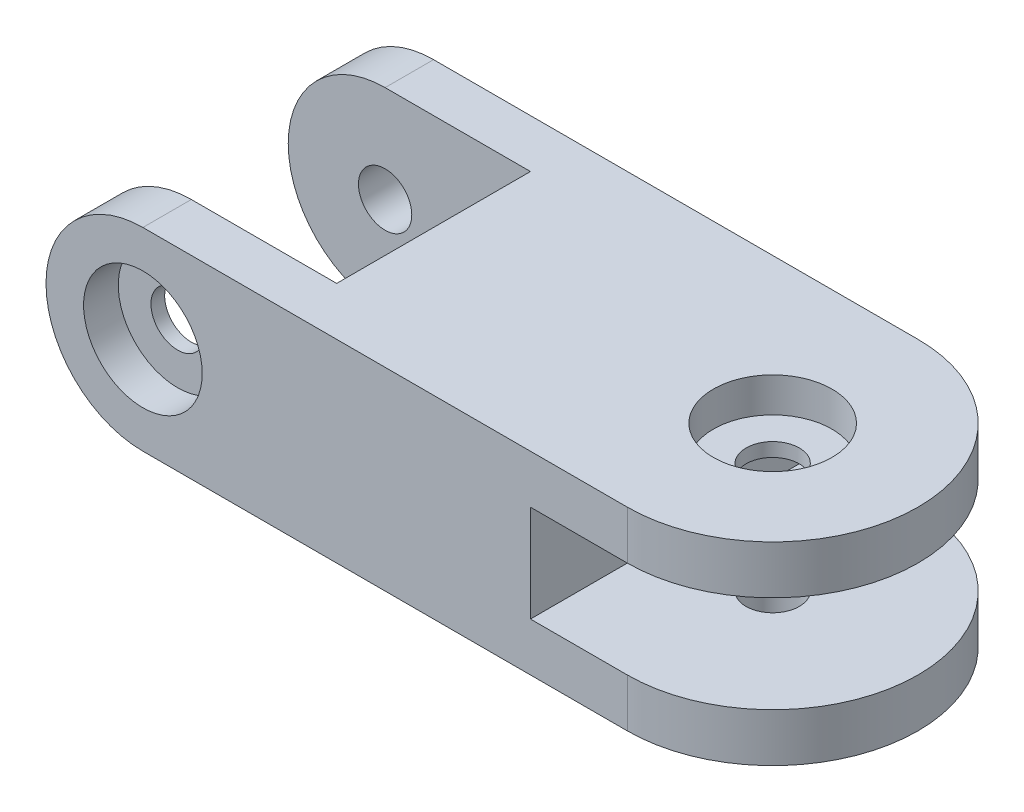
from build123d import *

# Parameters (mm, degrees)
SKETCH1_W                                         = 75
SKETCH1_H                                         = 20
EXTRUDE1_DEPTH                                    = 15
FILLET1_RADIUS                                    = 15
FILLET1_LENGTH                                    = 20
SKETCH3_W                                         = 25
SKETCH3_H                                         = 10
CUT_EXTRUDE1_DEPTH                                = 84.216584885
FILLET2_RADIUS                                    = 10
FILLET2_LENGTH                                    = 30
SKETCH4_W                                         = 25
SKETCH4_H                                         = 20
CUT_EXTRUDE2_DEPTH                                = 30
CBORE_FOR_M5_HEX_HEAD_BOLT1_D                     = 5.5
CBORE_FOR_M5_HEX_HEAD_BOLT1_CBORE_D               = 12.24
CBORE_FOR_M5_HEX_HEAD_BOLT1_CBORE_DEPTH           = 3.58
CBORE_FOR_M5_HEX_HEAD_BOLT1_ON_FACE_2_D           = 5.5
CBORE_FOR_M5_HEX_HEAD_BOLT1_ON_FACE_2_CBORE_D     = 12.24
CBORE_FOR_M5_HEX_HEAD_BOLT1_ON_FACE_2_CBORE_DEPTH = 3.58


with BuildPart() as part:
    # Sketch1 → Extrude1 (new, symmetric)
    with BuildSketch(Plane.XY):
        with Locations((37.5, 10)):
            Rectangle(SKETCH1_W, SKETCH1_H)
    extrude(amount=EXTRUDE1_DEPTH, both=True)

    # Fillet1: full round fillet: the end face becomes a half cylinder, R = half its width
    fillet1_face = Plane((75, 10, 0), x_dir=(0, -1, 0), z_dir=(1, 0, 0))  # on the end face: x along it, z out of the body
    fillet1_slab = fillet1_face.offset(-FILLET1_RADIUS / 2) * Box(FILLET1_LENGTH, 2 * FILLET1_RADIUS, FILLET1_RADIUS, mode=Mode.PRIVATE)  # the body's end, R deep
    fillet1_round = Plane((60, 10, 0), x_dir=(1, 0, 0), z_dir=(0, -1, 0)) * Cylinder(FILLET1_RADIUS, FILLET1_LENGTH, mode=Mode.PRIVATE)  # its axis R under the face
    add(fillet1_slab - fillet1_round, mode=Mode.SUBTRACT)

    # Sketch3 → Cut-Extrude1 (cut, through all)
    with BuildSketch(Plane.XY.offset(15)):
        with Locations((62.5, 10)):
            Rectangle(SKETCH3_W, SKETCH3_H)
    extrude(amount=-CUT_EXTRUDE1_DEPTH, mode=Mode.SUBTRACT)

    # Fillet2: full round fillet: the end face becomes a half cylinder, R = half its width
    fillet2_face = Plane((0, 10, 0), x_dir=(0, 0, -1), z_dir=(-1, 0, 0))  # on the end face: x along it, z out of the body
    fillet2_slab = fillet2_face.offset(-FILLET2_RADIUS / 2) * Box(FILLET2_LENGTH, 2 * FILLET2_RADIUS, FILLET2_RADIUS, mode=Mode.PRIVATE)  # the body's end, R deep
    fillet2_round = Plane((10, 10, 0), x_dir=(-1, 0, 0), z_dir=(0, 0, -1)) * Cylinder(FILLET2_RADIUS, FILLET2_LENGTH, mode=Mode.PRIVATE)  # its axis R under the face
    add(fillet2_slab - fillet2_round, mode=Mode.SUBTRACT)

    # Sketch4 → Cut-Extrude2 (cut)
    with BuildSketch(Plane(origin=(0, 20, 0), x_dir=(-1, 0, 0), z_dir=(0, 1, 0))):
        with Locations((-12.5, 0)):
            Rectangle(SKETCH4_W, SKETCH4_H)
    extrude(amount=-CUT_EXTRUDE2_DEPTH, mode=Mode.SUBTRACT)

    # CBORE for M5 Hex Head Bolt1 (through all)
    with Locations(Plane(origin=(60, 20, 0), x_dir=(0, 0, 1), z_dir=(0, 1, 0))):
        with Locations((0, 0)):
            CounterBoreHole(CBORE_FOR_M5_HEX_HEAD_BOLT1_D / 2, CBORE_FOR_M5_HEX_HEAD_BOLT1_CBORE_D / 2, CBORE_FOR_M5_HEX_HEAD_BOLT1_CBORE_DEPTH)

    # CBORE for M5 Hex Head Bolt1 on face 2 (through all)
    with Locations(Plane(origin=(10, 10, 15), x_dir=(1, 0, 0), z_dir=(0, 0, 1))):
        with Locations((0, 0)):
            CounterBoreHole(CBORE_FOR_M5_HEX_HEAD_BOLT1_ON_FACE_2_D / 2, CBORE_FOR_M5_HEX_HEAD_BOLT1_ON_FACE_2_CBORE_D / 2, CBORE_FOR_M5_HEX_HEAD_BOLT1_ON_FACE_2_CBORE_DEPTH)


solid = part.part
